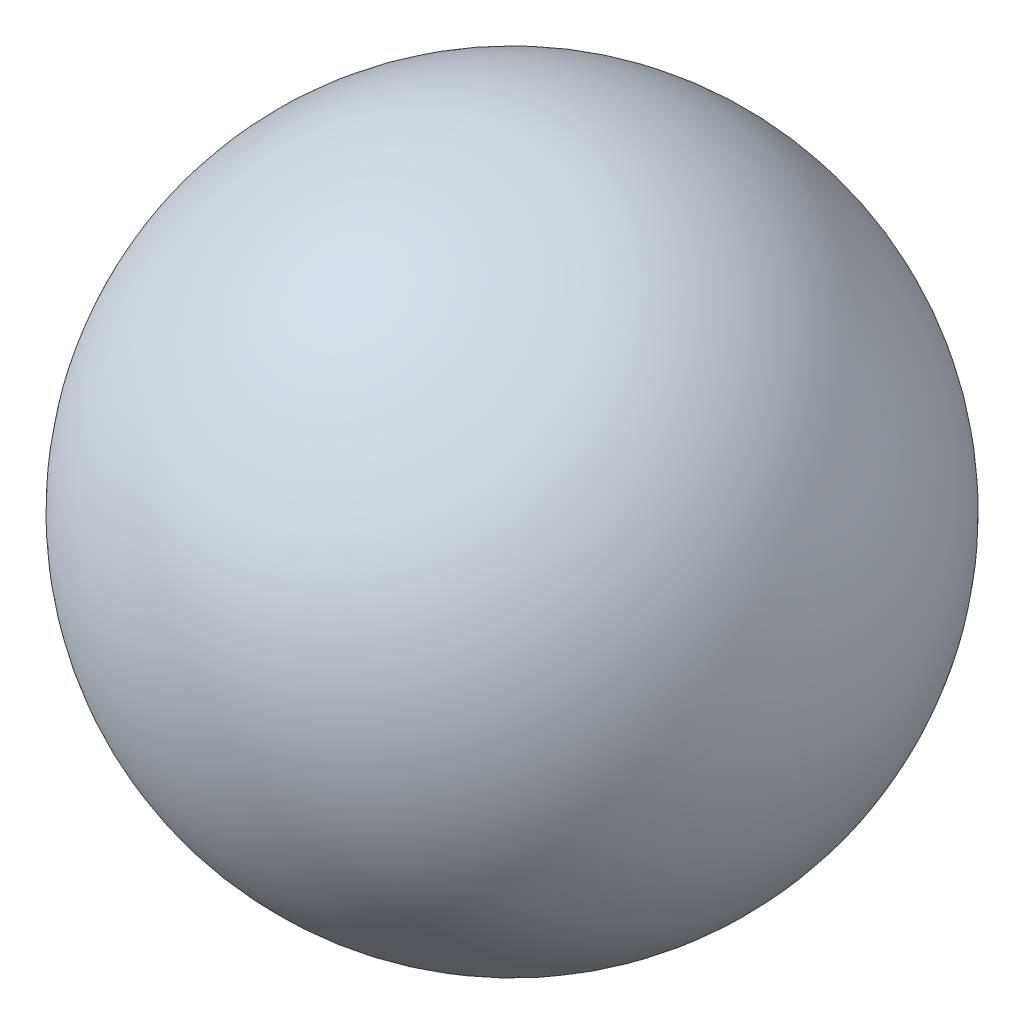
from build123d import *


with BuildPart() as part:
    # Sketch1 → Revolve1 (revolve)
    with BuildSketch(Plane(origin=(0, 0, 0), x_dir=(1, 0, 0), z_dir=(0, 1, 0))):
        with BuildLine():
            Line((-2, 0), (2, 0))
            ThreePointArc((2, 0), (0, 2), (-2, 0))
        make_face()
    revolve(axis=Axis((-2, 0, 0), (1, 0, 0)))


solid = part.part
